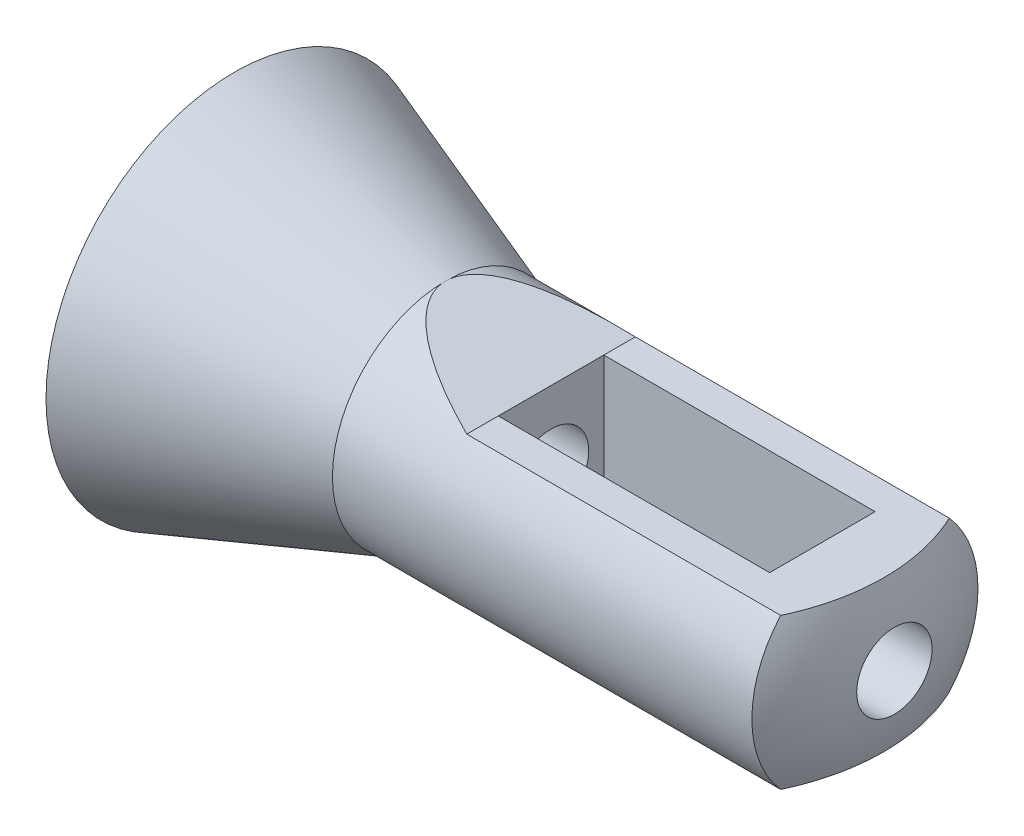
from build123d import *

# Parameters (mm, degrees)
CUT_EXTRUDE1_DEPTH      = 151.55326403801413
CUT_EXTRUDE2_DEPTH      = 151.55326403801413
CUT_EXTRUDE2_DEPTH_BACK = 151.55326403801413


with BuildPart() as part:
    # Sketch1 → Base-Revolve (revolve)
    with BuildSketch(Plane(origin=(0, 0, 0), x_dir=(1, 0, 0), z_dir=(0, 1, 0)), mode=Mode.PRIVATE) as base_revolve_sk:
        with BuildLine():
            Line((0, 0), (0, 39.6875))
            Line((0, 39.6875), (44.449999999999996, 23.8125))
            Line((44.449999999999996, 23.8125), (132.78354957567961, 23.8125))
            ThreePointArc((132.78354957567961, 23.8125), (137.93588044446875, 12.398310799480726), (139.7, 0))
            Line((139.7, 0), (0, 0))
        make_face()
    revolve(base_revolve_sk.sketch.rotate(Axis((0, 0, 0), (1, 0, 0)), 180), axis=Axis((0, 0, 0), (1, 0, 0)))

    # Sketch2 → Cut-Extrude1 (cut, symmetric)
    with BuildSketch(Plane.XY):
        Polygon((468.11866803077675, 15.875), (136.7685124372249, 15.875), (66.675, 15.875), (0, 39.6875), (-312.0463289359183, 151.13261747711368), (-198.84233592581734, 804.0924618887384), (581.3226610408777, 668.8348444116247), align=None)
    cut_extrude1 = extrude(amount=CUT_EXTRUDE1_DEPTH, both=True, mode=Mode.SUBTRACT)

    # Mirror1: Cut-Extrude1 across plane
    add(cut_extrude1.mirror(Plane.ZX), mode=Mode.SUBTRACT)

    # Sketch3 → Cut-Extrude2 (cut, two sides: drawn at the far end of the back side and taken through both)
    with BuildSketch(Plane(origin=(0, 0, 0), x_dir=(-1, 0, 0), z_dir=(0, 1, 0)).offset(-CUT_EXTRUDE2_DEPTH_BACK)):
        Polygon((-66.675, -11.112500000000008), (-123.82499999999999, -11.112500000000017), (-123.82499999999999, 11.112499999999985), (-66.675, 11.11249999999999), align=None)
    extrude(amount=CUT_EXTRUDE2_DEPTH + CUT_EXTRUDE2_DEPTH_BACK, mode=Mode.SUBTRACT)

    # Sketch4 → Cut-Revolve1 (revolve, cut)
    with BuildSketch(Plane(origin=(0, 0, 0), x_dir=(1, 0, 0), z_dir=(0, 1, 0)), mode=Mode.PRIVATE) as cut_revolve1_sk:
        with BuildLine():
            Line((41.70023172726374, 7.9375), (-6e-17, 22.8304399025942))
            Line((-6e-17, 22.8304399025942), (0, 0))
            Line((0, 0), (139.7, 0))
            ThreePointArc((139.7, 0), (139.52102793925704, 3.9847942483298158), (138.98555297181, 7.9375))
            Line((138.98555297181, 7.9375), (41.70023172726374, 7.9375))
        make_face()
    revolve(cut_revolve1_sk.sketch.rotate(Axis((0, 0, 0), (1, 0, 0)), 180), axis=Axis((0, 0, 0), (1, 0, 0)), mode=Mode.SUBTRACT)


solid = part.part
